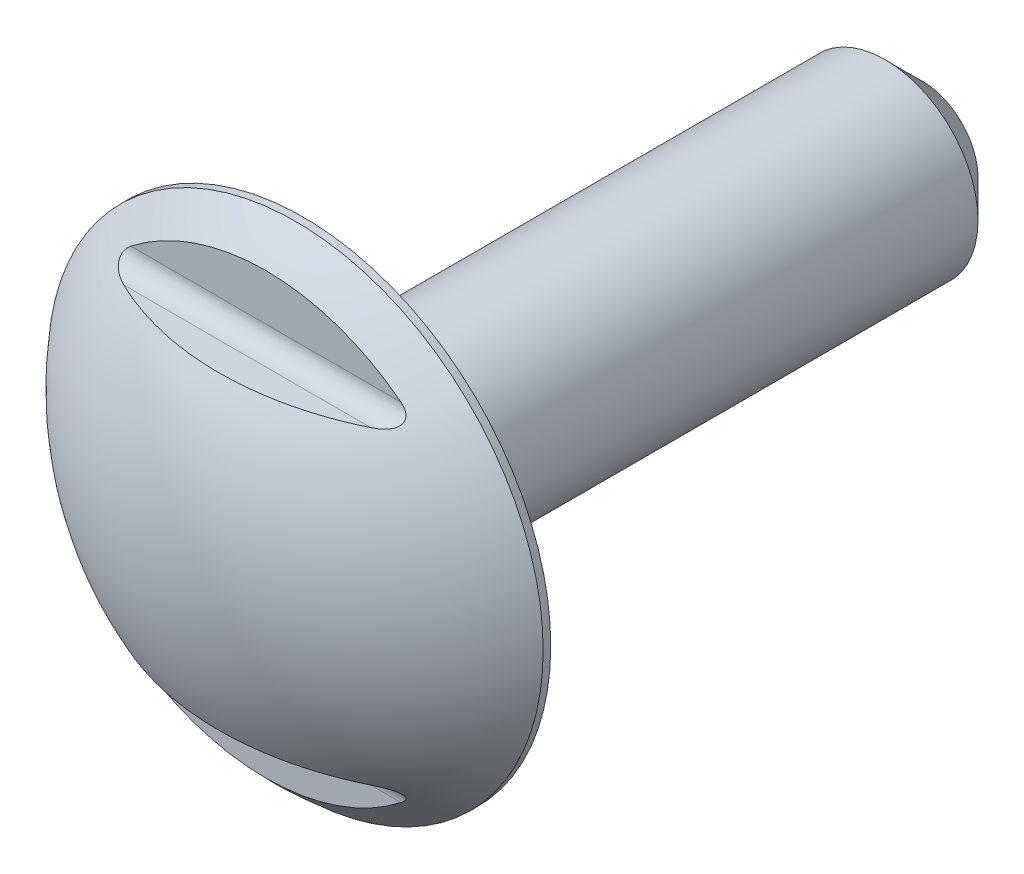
ISO-10303-21;
HEADER;
FILE_DESCRIPTION(('STEP AP214'),'2;1');
FILE_NAME('part.step','',(''),(''),'','','');
FILE_SCHEMA(('AUTOMOTIVE_DESIGN { 1 0 10303 214 1 1 1 1 }'));
ENDSEC;
DATA;
#1=APPLICATION_CONTEXT('core data for automotive mechanical design processes');
#2=APPLICATION_PROTOCOL_DEFINITION('international standard','automotive_design',2000,#1);
#3=PRODUCT_CONTEXT('',#1,'mechanical');
#4=PRODUCT('Part','Part','',(#3));
#5=PRODUCT_RELATED_PRODUCT_CATEGORY('part','',(#4));
#6=PRODUCT_DEFINITION_FORMATION('','',#4);
#7=PRODUCT_DEFINITION_CONTEXT('part definition',#1,'design');
#8=PRODUCT_DEFINITION('design','',#6,#7);
#9=PRODUCT_DEFINITION_SHAPE('','',#8);
#10=(LENGTH_UNIT() NAMED_UNIT(*) SI_UNIT(.MILLI.,.METRE.));
#11=(NAMED_UNIT(*) PLANE_ANGLE_UNIT() SI_UNIT($,.RADIAN.));
#12=(NAMED_UNIT(*) SI_UNIT($,.STERADIAN.) SOLID_ANGLE_UNIT());
#13=UNCERTAINTY_MEASURE_WITH_UNIT(LENGTH_MEASURE(1.E-05),#10,'distance_accuracy_value','');
#14=(GEOMETRIC_REPRESENTATION_CONTEXT(3) GLOBAL_UNCERTAINTY_ASSIGNED_CONTEXT((#13)) GLOBAL_UNIT_ASSIGNED_CONTEXT((#10,
#11,#12)) REPRESENTATION_CONTEXT('',''));
#15=CARTESIAN_POINT('',(0.,0.,0.));
#16=DIRECTION('',(0.,0.,1.));
#17=DIRECTION('',(1.,0.,0.));
#18=AXIS2_PLACEMENT_3D('',#15,#16,#17);
#19=CARTESIAN_POINT('',(0.,0.,-8.));
#20=DIRECTION('',(0.,0.,-1.));
#21=DIRECTION('',(1.,0.,0.));
#22=AXIS2_PLACEMENT_3D('',#19,#20,#21);
#23=CYLINDRICAL_SURFACE('',#22,4.);
#24=CARTESIAN_POINT('',(0.,0.,0.));
#25=DIRECTION('',(0.,0.,-1.));
#26=DIRECTION('',(1.,0.,0.));
#27=AXIS2_PLACEMENT_3D('',#24,#25,#26);
#28=CIRCLE('',#27,4.);
#29=CARTESIAN_POINT('',(4.,0.,0.));
#30=VERTEX_POINT('',#29);
#31=EDGE_CURVE('E59',#30,#30,#28,.T.);
#32=ORIENTED_EDGE('',*,*,#31,.F.);
#33=EDGE_LOOP('',(#32));
#34=FACE_BOUND('',#33,.T.);
#35=CARTESIAN_POINT('',(0.,0.,0.12264954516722));
#36=DIRECTION('',(0.,0.,1.));
#37=DIRECTION('',(-1.,0.,0.));
#38=AXIS2_PLACEMENT_3D('',#35,#36,#37);
#39=CIRCLE('',#38,4.);
#40=CARTESIAN_POINT('',(-4.,0.,0.12264954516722));
#41=VERTEX_POINT('',#40);
#42=EDGE_CURVE('E174',#41,#41,#39,.T.);
#43=ORIENTED_EDGE('',*,*,#42,.F.);
#44=EDGE_LOOP('',(#43));
#45=FACE_BOUND('',#44,.T.);
#46=ADVANCED_FACE('F14',(#34,#45),#23,.T.);
#47=CARTESIAN_POINT('',(0.,-4.,0.));
#48=DIRECTION('',(0.,0.,1.));
#49=DIRECTION('',(-1.,0.,0.));
#50=AXIS2_PLACEMENT_3D('',#47,#48,#49);
#51=PLANE('',#50);
#52=CARTESIAN_POINT('',(0.,0.,0.));
#53=DIRECTION('',(0.,0.,-1.));
#54=DIRECTION('',(1.,0.,0.));
#55=AXIS2_PLACEMENT_3D('',#52,#53,#54);
#56=CIRCLE('',#55,1.3);
#57=CARTESIAN_POINT('',(1.3,0.,0.));
#58=VERTEX_POINT('',#57);
#59=EDGE_CURVE('E188',#58,#58,#56,.T.);
#60=ORIENTED_EDGE('',*,*,#59,.F.);
#61=EDGE_LOOP('',(#60));
#62=FACE_BOUND('',#61,.T.);
#63=ORIENTED_EDGE('',*,*,#31,.T.);
#64=EDGE_LOOP('',(#63));
#65=FACE_BOUND('',#64,.T.);
#66=ADVANCED_FACE('F137',(#62,#65),#51,.F.);
#67=CARTESIAN_POINT('',(0.,0.,-0.2));
#68=DIRECTION('',(0.,0.,-1.));
#69=DIRECTION('',(1.,0.,0.));
#70=AXIS2_PLACEMENT_3D('',#67,#68,#69);
#71=TOROIDAL_SURFACE('',#70,1.3,0.2);
#72=CARTESIAN_POINT('',(0.,0.,-0.2));
#73=DIRECTION('',(0.,0.,-1.));
#74=DIRECTION('',(1.,0.,0.));
#75=AXIS2_PLACEMENT_3D('',#72,#73,#74);
#76=CIRCLE('',#75,1.1);
#77=CARTESIAN_POINT('',(1.1,0.,-0.2));
#78=VERTEX_POINT('',#77);
#79=EDGE_CURVE('E185',#78,#78,#76,.T.);
#80=ORIENTED_EDGE('',*,*,#79,.F.);
#81=EDGE_LOOP('',(#80));
#82=FACE_BOUND('',#81,.T.);
#83=ORIENTED_EDGE('',*,*,#59,.T.);
#84=EDGE_LOOP('',(#83));
#85=FACE_BOUND('',#84,.T.);
#86=ADVANCED_FACE('F142',(#82,#85),#71,.F.);
#87=CARTESIAN_POINT('',(0.,0.,-8.));
#88=DIRECTION('',(0.,0.,-1.));
#89=DIRECTION('',(1.,0.,0.));
#90=AXIS2_PLACEMENT_3D('',#87,#88,#89);
#91=CYLINDRICAL_SURFACE('',#90,1.1);
#92=CARTESIAN_POINT('',(0.,0.,-0.353589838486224));
#93=DIRECTION('',(0.,0.,-1.));
#94=DIRECTION('',(1.,0.,0.));
#95=AXIS2_PLACEMENT_3D('',#92,#93,#94);
#96=CIRCLE('',#95,1.1);
#97=CARTESIAN_POINT('',(1.1,0.,-0.353589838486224));
#98=VERTEX_POINT('',#97);
#99=EDGE_CURVE('E177',#98,#98,#96,.T.);
#100=ORIENTED_EDGE('',*,*,#99,.F.);
#101=EDGE_LOOP('',(#100));
#102=FACE_BOUND('',#101,.T.);
#103=ORIENTED_EDGE('',*,*,#79,.T.);
#104=EDGE_LOOP('',(#103));
#105=FACE_BOUND('',#104,.T.);
#106=ADVANCED_FACE('F150',(#102,#105),#91,.T.);
#107=CARTESIAN_POINT('',(0.,0.,-0.353589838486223));
#108=DIRECTION('',(0.,0.,-1.));
#109=DIRECTION('',(1.,0.,0.));
#110=AXIS2_PLACEMENT_3D('',#107,#108,#109);
#111=TOROIDAL_SURFACE('',#110,1.3,0.200000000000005);
#112=CARTESIAN_POINT('',(0.,0.,-0.453589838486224));
#113=DIRECTION('',(0.,0.,-1.));
#114=DIRECTION('',(1.,0.,0.));
#115=AXIS2_PLACEMENT_3D('',#112,#113,#114);
#116=CIRCLE('',#115,1.12679491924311);
#117=CARTESIAN_POINT('',(1.12679491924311,0.,-0.453589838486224));
#118=VERTEX_POINT('',#117);
#119=EDGE_CURVE('E173',#118,#118,#116,.T.);
#120=ORIENTED_EDGE('',*,*,#119,.F.);
#121=EDGE_LOOP('',(#120));
#122=FACE_BOUND('',#121,.T.);
#123=ORIENTED_EDGE('',*,*,#99,.T.);
#124=EDGE_LOOP('',(#123));
#125=FACE_BOUND('',#124,.T.);
#126=ADVANCED_FACE('F154',(#122,#125),#111,.F.);
#127=CARTESIAN_POINT('',(0.,0.,-0.453589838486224));
#128=DIRECTION('',(0.,0.,-1.));
#129=DIRECTION('',(1.,0.,0.));
#130=AXIS2_PLACEMENT_3D('',#127,#128,#129);
#131=CONICAL_SURFACE('',#130,1.12679491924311,0.523598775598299);
#132=CARTESIAN_POINT('',(0.,0.,-1.1));
#133=DIRECTION('',(0.,0.,-1.));
#134=DIRECTION('',(1.,0.,0.));
#135=AXIS2_PLACEMENT_3D('',#132,#133,#134);
#136=CIRCLE('',#135,1.5);
#137=CARTESIAN_POINT('',(1.5,0.,-1.1));
#138=VERTEX_POINT('',#137);
#139=EDGE_CURVE('E172',#138,#138,#136,.T.);
#140=ORIENTED_EDGE('',*,*,#139,.F.);
#141=EDGE_LOOP('',(#140));
#142=FACE_BOUND('',#141,.T.);
#143=ORIENTED_EDGE('',*,*,#119,.T.);
#144=EDGE_LOOP('',(#143));
#145=FACE_BOUND('',#144,.T.);
#146=ADVANCED_FACE('F158',(#142,#145),#131,.T.);
#147=CARTESIAN_POINT('',(0.,0.,-8.));
#148=DIRECTION('',(0.,0.,-1.));
#149=DIRECTION('',(1.,0.,0.));
#150=AXIS2_PLACEMENT_3D('',#147,#148,#149);
#151=CYLINDRICAL_SURFACE('',#150,1.5);
#152=CARTESIAN_POINT('',(0.,0.,-9.4));
#153=DIRECTION('',(0.,0.,-1.));
#154=DIRECTION('',(-1.,0.,0.));
#155=AXIS2_PLACEMENT_3D('',#152,#153,#154);
#156=CIRCLE('',#155,1.5);
#157=CARTESIAN_POINT('',(-1.5,0.,-9.4));
#158=VERTEX_POINT('',#157);
#159=EDGE_CURVE('E9',#158,#158,#156,.F.);
#160=ORIENTED_EDGE('',*,*,#159,.T.);
#161=EDGE_LOOP('',(#160));
#162=FACE_BOUND('',#161,.T.);
#163=ORIENTED_EDGE('',*,*,#139,.T.);
#164=EDGE_LOOP('',(#163));
#165=FACE_BOUND('',#164,.T.);
#166=ADVANCED_FACE('F161',(#162,#165),#151,.T.);
#167=CARTESIAN_POINT('',(0.,0.,-3.2));
#168=DIRECTION('',(0.,0.,1.));
#169=DIRECTION('',(0.,-1.,0.));
#170=AXIS2_PLACEMENT_3D('',#167,#168,#169);
#171=SPHERICAL_SURFACE('',#170,5.2);
#172=CARTESIAN_POINT('',(0.,2.5,-3.2));
#173=DIRECTION('',(0.,-1.,0.));
#174=DIRECTION('',(1.,0.,0.));
#175=AXIS2_PLACEMENT_3D('',#172,#173,#174);
#176=CIRCLE('',#175,4.5596052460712);
#177=CARTESIAN_POINT('',(-1.99499373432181,2.5,0.9));
#178=VERTEX_POINT('',#177);
#179=CARTESIAN_POINT('',(1.994993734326,2.5,0.9));
#180=VERTEX_POINT('',#179);
#181=EDGE_CURVE('E124',#178,#180,#176,.F.);
#182=ORIENTED_EDGE('',*,*,#181,.F.);
#183=CARTESIAN_POINT('',(-2.18148560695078,2.8002,0.600000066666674));
#184=CARTESIAN_POINT('',(-2.19362930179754,2.7907147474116,0.600019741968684));
#185=CARTESIAN_POINT('',(-2.20552699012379,2.78074549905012,0.600440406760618));
#186=CARTESIAN_POINT('',(-2.22841120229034,2.75955495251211,0.602536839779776));
#187=CARTESIAN_POINT('',(-2.23937741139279,2.7483143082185,0.604235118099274));
#188=CARTESIAN_POINT('',(-2.25595559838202,2.72879878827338,0.608467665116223));
#189=CARTESIAN_POINT('',(-2.26209375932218,2.72087219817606,0.610497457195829));
#190=CARTESIAN_POINT('',(-2.27325803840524,2.70456948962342,0.61545602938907));
#191=CARTESIAN_POINT('',(-2.27828965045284,2.69619586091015,0.618380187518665));
#192=CARTESIAN_POINT('',(-2.28588020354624,2.68105068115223,0.624497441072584));
#193=CARTESIAN_POINT('',(-2.28874117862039,2.67434707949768,0.627478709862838));
#194=CARTESIAN_POINT('',(-2.29334802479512,2.66087716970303,0.634103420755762));
#195=CARTESIAN_POINT('',(-2.29509452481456,2.6541108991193,0.637746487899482));
#196=CARTESIAN_POINT('',(-2.29730461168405,2.64068344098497,0.645678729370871));
#197=CARTESIAN_POINT('',(-2.29775998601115,2.63402319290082,0.649971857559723));
#198=CARTESIAN_POINT('',(-2.29731000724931,2.6210966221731,0.659051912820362));
#199=CARTESIAN_POINT('',(-2.29640447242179,2.61483035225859,0.663838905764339));
#200=CARTESIAN_POINT('',(-2.29348190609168,2.60344375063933,0.673250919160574));
#201=CARTESIAN_POINT('',(-2.29157722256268,2.59827106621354,0.677848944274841));
#202=CARTESIAN_POINT('',(-2.28688710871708,2.58846666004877,0.68716336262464));
#203=CARTESIAN_POINT('',(-2.28410141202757,2.58383510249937,0.691879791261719));
#204=CARTESIAN_POINT('',(-2.2759175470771,2.57248877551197,0.704181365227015));
#205=CARTESIAN_POINT('',(-2.26995648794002,2.56619967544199,0.71178320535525));
#206=CARTESIAN_POINT('',(-2.25676803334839,2.55486022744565,0.726807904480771));
#207=CARTESIAN_POINT('',(-2.24953697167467,2.54981357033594,0.734230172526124));
#208=CARTESIAN_POINT('',(-2.228331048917,2.53726193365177,0.754396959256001));
#209=CARTESIAN_POINT('',(-2.21344357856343,2.53084751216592,0.766848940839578));
#210=CARTESIAN_POINT('',(-2.18216661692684,2.52025272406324,0.790851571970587));
#211=CARTESIAN_POINT('',(-2.16576887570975,2.51608559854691,0.802396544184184));
#212=CARTESIAN_POINT('',(-2.12425701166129,2.50783454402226,0.829788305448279));
#213=CARTESIAN_POINT('',(-2.09863400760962,2.50468951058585,0.845140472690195));
#214=CARTESIAN_POINT('',(-2.05972898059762,2.50175690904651,0.866810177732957));
#215=CARTESIAN_POINT('',(-2.0468228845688,2.50107500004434,0.873739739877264));
#216=CARTESIAN_POINT('',(-2.02083255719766,2.50019563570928,0.88723270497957));
#217=CARTESIAN_POINT('',(-2.00774867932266,2.49999732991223,0.893796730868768));
#218=CARTESIAN_POINT('',(-1.99458256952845,2.50000006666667,0.900199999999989));
#219=B_SPLINE_CURVE_WITH_KNOTS('',3,(#183,#184,#185,#186,#187,#188,#189,#190,#191,#192,#193,
#194,#195,#196,#197,#198,#199,#200,#201,#202,#203,#204,#205,#206,#207,#208,#209,#210,#211,#212,
#213,#214,#215,#216,#217,#218),.UNSPECIFIED.,.F.,.F.,(4,2,2,2,2,2,2,2,2,2,2,2,2,2,2,2,2,4),(0.,
0.0463823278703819,0.0936015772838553,0.124204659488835,0.154652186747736,0.17818623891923,
0.201706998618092,0.225377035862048,0.249050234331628,0.270500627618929,0.291957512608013,
0.326339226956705,0.360821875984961,0.421799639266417,0.483132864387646,0.572973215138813,
0.61696059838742,0.660870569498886),.UNSPECIFIED.);
#220=CARTESIAN_POINT('',(-2.18174242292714,2.8,0.6));
#221=VERTEX_POINT('',#220);
#222=EDGE_CURVE('E111',#221,#178,#219,.T.);
#223=ORIENTED_EDGE('',*,*,#222,.F.);
#224=CARTESIAN_POINT('',(0.,0.,0.6));
#225=DIRECTION('',(0.,0.,-1.));
#226=DIRECTION('',(0.,-1.,0.));
#227=AXIS2_PLACEMENT_3D('',#224,#225,#226);
#228=CIRCLE('',#227,3.54964786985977);
#229=CARTESIAN_POINT('',(2.18174242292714,2.8,0.6));
#230=VERTEX_POINT('',#229);
#231=EDGE_CURVE('E208',#230,#221,#228,.F.);
#232=ORIENTED_EDGE('',*,*,#231,.F.);
#233=CARTESIAN_POINT('',(1.99458256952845,2.50000006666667,0.900199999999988));
#234=CARTESIAN_POINT('',(2.00924618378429,2.5000008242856,0.89306640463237));
#235=CARTESIAN_POINT('',(2.02381938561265,2.50024530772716,0.88573062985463));
#236=CARTESIAN_POINT('',(2.05275138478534,2.50134632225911,0.870595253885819));
#237=CARTESIAN_POINT('',(2.06710944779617,2.50220460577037,0.862794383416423));
#238=CARTESIAN_POINT('',(2.09559928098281,2.50466845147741,0.846649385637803));
#239=CARTESIAN_POINT('',(2.10972854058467,2.50627957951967,0.838301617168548));
#240=CARTESIAN_POINT('',(2.13750512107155,2.51043126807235,0.821079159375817));
#241=CARTESIAN_POINT('',(2.15115302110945,2.51297066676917,0.812205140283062));
#242=CARTESIAN_POINT('',(2.17627000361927,2.51887670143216,0.794912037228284));
#243=CARTESIAN_POINT('',(2.18781075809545,2.52211702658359,0.786555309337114));
#244=CARTESIAN_POINT('',(2.21014903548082,2.52978442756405,0.769338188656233));
#245=CARTESIAN_POINT('',(2.22094523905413,2.53421354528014,0.760476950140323));
#246=CARTESIAN_POINT('',(2.24153862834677,2.54467843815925,0.742123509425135));
#247=CARTESIAN_POINT('',(2.2513161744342,2.55073975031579,0.73262325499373));
#248=CARTESIAN_POINT('',(2.26886803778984,2.56488191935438,0.713289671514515));
#249=CARTESIAN_POINT('',(2.27665487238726,2.5729494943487,0.70345888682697));
#250=CARTESIAN_POINT('',(2.28604704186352,2.58697138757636,0.688653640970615));
#251=CARTESIAN_POINT('',(2.2888237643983,2.59207417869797,0.68361895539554));
#252=CARTESIAN_POINT('',(2.29331344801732,2.60288770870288,0.673725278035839));
#253=CARTESIAN_POINT('',(2.29502729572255,2.60859793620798,0.668866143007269));
#254=CARTESIAN_POINT('',(2.29723548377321,2.62055773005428,0.6594618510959));
#255=CARTESIAN_POINT('',(2.29772227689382,2.62681039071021,0.654918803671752));
#256=CARTESIAN_POINT('',(2.29739959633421,2.6396274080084,0.64634653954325));
#257=CARTESIAN_POINT('',(2.29658995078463,2.64619180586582,0.642317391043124));
#258=CARTESIAN_POINT('',(2.29386629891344,2.65892418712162,0.635146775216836));
#259=CARTESIAN_POINT('',(2.29203628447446,2.66508655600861,0.631962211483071));
#260=CARTESIAN_POINT('',(2.28748498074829,2.67733185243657,0.626141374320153));
#261=CARTESIAN_POINT('',(2.28476373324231,2.6834147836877,0.623505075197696));
#262=CARTESIAN_POINT('',(2.27680636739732,2.69887909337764,0.617372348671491));
#263=CARTESIAN_POINT('',(2.27102624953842,2.70813198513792,0.614261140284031));
#264=CARTESIAN_POINT('',(2.25818412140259,2.72607760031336,0.609098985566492));
#265=CARTESIAN_POINT('',(2.25111402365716,2.73476629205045,0.607055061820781));
#266=CARTESIAN_POINT('',(2.23421100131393,2.75365124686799,0.603407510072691));
#267=CARTESIAN_POINT('',(2.2241325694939,2.76366946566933,0.602047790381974));
#268=CARTESIAN_POINT('',(2.20326210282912,2.78264375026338,0.600358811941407));
#269=CARTESIAN_POINT('',(2.19248616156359,2.79161567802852,0.600011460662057));
#270=CARTESIAN_POINT('',(2.18148560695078,2.8002,0.600000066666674));
#271=B_SPLINE_CURVE_WITH_KNOTS('',3,(#233,#234,#235,#236,#237,#238,#239,#240,#241,#242,#243,
#244,#245,#246,#247,#248,#249,#250,#251,#252,#253,#254,#255,#256,#257,#258,#259,#260,#261,#262,
#263,#264,#265,#266,#267,#268,#269,#270),.UNSPECIFIED.,.F.,.F.,(4,2,2,2,2,2,2,2,2,2,2,2,2,2,2,2,
2,2,4),(0.,0.0489276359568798,0.0979955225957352,0.147432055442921,0.196806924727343,
0.240588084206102,0.284444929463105,0.329032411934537,0.373332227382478,0.396312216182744,
0.419273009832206,0.442374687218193,0.465479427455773,0.486915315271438,0.508350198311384,
0.542190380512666,0.576250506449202,0.618966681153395,0.660914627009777),.UNSPECIFIED.);
#272=EDGE_CURVE('E118',#180,#230,#271,.T.);
#273=ORIENTED_EDGE('',*,*,#272,.F.);
#274=EDGE_LOOP('',(#182,#223,#232,#273));
#275=FACE_BOUND('',#274,.T.);
#276=CARTESIAN_POINT('',(0.,-2.5,-3.2));
#277=DIRECTION('',(0.,1.,0.));
#278=DIRECTION('',(-1.,0.,0.));
#279=AXIS2_PLACEMENT_3D('',#276,#277,#278);
#280=CIRCLE('',#279,4.55960524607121);
#281=CARTESIAN_POINT('',(1.99499373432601,-2.5,0.9));
#282=VERTEX_POINT('',#281);
#283=CARTESIAN_POINT('',(-1.99499373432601,-2.5,0.9));
#284=VERTEX_POINT('',#283);
#285=EDGE_CURVE('E71',#282,#284,#280,.F.);
#286=ORIENTED_EDGE('',*,*,#285,.F.);
#287=CARTESIAN_POINT('',(2.1814856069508,-2.8002,0.600000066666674));
#288=CARTESIAN_POINT('',(2.19362930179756,-2.7907147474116,0.600019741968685));
#289=CARTESIAN_POINT('',(2.20552699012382,-2.78074549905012,0.600440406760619));
#290=CARTESIAN_POINT('',(2.22841120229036,-2.75955495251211,0.602536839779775));
#291=CARTESIAN_POINT('',(2.23937741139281,-2.74831430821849,0.604235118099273));
#292=CARTESIAN_POINT('',(2.25595559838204,-2.72879878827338,0.608467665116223));
#293=CARTESIAN_POINT('',(2.2620937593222,-2.72087219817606,0.610497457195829));
#294=CARTESIAN_POINT('',(2.27325803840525,-2.70456948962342,0.61545602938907));
#295=CARTESIAN_POINT('',(2.27828965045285,-2.69619586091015,0.618380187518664));
#296=CARTESIAN_POINT('',(2.28588020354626,-2.68105068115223,0.624497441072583));
#297=CARTESIAN_POINT('',(2.28874117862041,-2.67434707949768,0.627478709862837));
#298=CARTESIAN_POINT('',(2.29334802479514,-2.66087716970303,0.634103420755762));
#299=CARTESIAN_POINT('',(2.29509452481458,-2.6541108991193,0.637746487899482));
#300=CARTESIAN_POINT('',(2.29730461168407,-2.64068344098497,0.645678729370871));
#301=CARTESIAN_POINT('',(2.29775998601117,-2.63402319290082,0.649971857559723));
#302=CARTESIAN_POINT('',(2.29731000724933,-2.62109662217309,0.659051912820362));
#303=CARTESIAN_POINT('',(2.29640447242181,-2.61483035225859,0.663838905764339));
#304=CARTESIAN_POINT('',(2.2934819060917,-2.60344375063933,0.673250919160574));
#305=CARTESIAN_POINT('',(2.2915772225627,-2.59827106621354,0.677848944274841));
#306=CARTESIAN_POINT('',(2.28688710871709,-2.58846666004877,0.68716336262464));
#307=CARTESIAN_POINT('',(2.28410141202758,-2.58383510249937,0.691879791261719));
#308=CARTESIAN_POINT('',(2.27591754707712,-2.57248877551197,0.704181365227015));
#309=CARTESIAN_POINT('',(2.26995648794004,-2.56619967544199,0.711783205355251));
#310=CARTESIAN_POINT('',(2.25676803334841,-2.55486022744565,0.726807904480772));
#311=CARTESIAN_POINT('',(2.24953697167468,-2.54981357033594,0.734230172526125));
#312=CARTESIAN_POINT('',(2.22833104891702,-2.53726193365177,0.754396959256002));
#313=CARTESIAN_POINT('',(2.21344357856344,-2.53084751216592,0.76684894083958));
#314=CARTESIAN_POINT('',(2.18216661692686,-2.52025272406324,0.79085157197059));
#315=CARTESIAN_POINT('',(2.16576887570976,-2.5160855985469,0.802396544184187));
#316=CARTESIAN_POINT('',(2.12425701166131,-2.50783454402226,0.829788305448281));
#317=CARTESIAN_POINT('',(2.09863400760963,-2.50468951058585,0.845140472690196));
#318=CARTESIAN_POINT('',(2.05972898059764,-2.50175690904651,0.866810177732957));
#319=CARTESIAN_POINT('',(2.04682288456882,-2.50107500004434,0.873739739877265));
#320=CARTESIAN_POINT('',(2.02083255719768,-2.50019563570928,0.88723270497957));
#321=CARTESIAN_POINT('',(2.00774867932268,-2.49999732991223,0.893796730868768));
#322=CARTESIAN_POINT('',(1.99458256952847,-2.50000006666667,0.900199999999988));
#323=B_SPLINE_CURVE_WITH_KNOTS('',3,(#287,#288,#289,#290,#291,#292,#293,#294,#295,#296,#297,
#298,#299,#300,#301,#302,#303,#304,#305,#306,#307,#308,#309,#310,#311,#312,#313,#314,#315,#316,
#317,#318,#319,#320,#321,#322),.UNSPECIFIED.,.F.,.F.,(4,2,2,2,2,2,2,2,2,2,2,2,2,2,2,2,2,4),(0.,
0.0463823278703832,0.0936015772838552,0.124204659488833,0.154652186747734,0.178186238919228,
0.201706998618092,0.225377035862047,0.249050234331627,0.270500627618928,0.291957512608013,
0.326339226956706,0.360821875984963,0.421799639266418,0.483132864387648,0.572973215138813,
0.616960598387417,0.660870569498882),.UNSPECIFIED.);
#324=CARTESIAN_POINT('',(2.18174242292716,-2.8,0.6));
#325=VERTEX_POINT('',#324);
#326=EDGE_CURVE('E58',#325,#282,#323,.T.);
#327=ORIENTED_EDGE('',*,*,#326,.F.);
#328=CARTESIAN_POINT('',(0.,0.,0.6));
#329=DIRECTION('',(0.,0.,-1.));
#330=DIRECTION('',(0.,-1.,0.));
#331=AXIS2_PLACEMENT_3D('',#328,#329,#330);
#332=CIRCLE('',#331,3.54964786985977);
#333=CARTESIAN_POINT('',(-2.18174242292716,-2.8,0.6));
#334=VERTEX_POINT('',#333);
#335=EDGE_CURVE('E53',#334,#325,#332,.F.);
#336=ORIENTED_EDGE('',*,*,#335,.F.);
#337=CARTESIAN_POINT('',(-1.99458256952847,-2.50000006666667,0.900199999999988));
#338=CARTESIAN_POINT('',(-2.00924618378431,-2.5000008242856,0.89306640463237));
#339=CARTESIAN_POINT('',(-2.02381938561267,-2.50024530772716,0.88573062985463));
#340=CARTESIAN_POINT('',(-2.05275138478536,-2.50134632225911,0.870595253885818));
#341=CARTESIAN_POINT('',(-2.06710944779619,-2.50220460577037,0.862794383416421));
#342=CARTESIAN_POINT('',(-2.09559928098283,-2.50466845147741,0.846649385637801));
#343=CARTESIAN_POINT('',(-2.10972854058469,-2.50627957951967,0.838301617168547));
#344=CARTESIAN_POINT('',(-2.13750512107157,-2.51043126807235,0.821079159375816));
#345=CARTESIAN_POINT('',(-2.15115302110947,-2.51297066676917,0.812205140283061));
#346=CARTESIAN_POINT('',(-2.17627000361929,-2.51887670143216,0.794912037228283));
#347=CARTESIAN_POINT('',(-2.18781075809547,-2.52211702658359,0.786555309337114));
#348=CARTESIAN_POINT('',(-2.21014903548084,-2.52978442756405,0.769338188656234));
#349=CARTESIAN_POINT('',(-2.22094523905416,-2.53421354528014,0.760476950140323));
#350=CARTESIAN_POINT('',(-2.24153862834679,-2.54467843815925,0.742123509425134));
#351=CARTESIAN_POINT('',(-2.25131617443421,-2.55073975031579,0.732623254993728));
#352=CARTESIAN_POINT('',(-2.26886803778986,-2.56488191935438,0.713289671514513));
#353=CARTESIAN_POINT('',(-2.27665487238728,-2.5729494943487,0.703458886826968));
#354=CARTESIAN_POINT('',(-2.28604704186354,-2.58697138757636,0.688653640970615));
#355=CARTESIAN_POINT('',(-2.28882376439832,-2.59207417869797,0.683618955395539));
#356=CARTESIAN_POINT('',(-2.29331344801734,-2.60288770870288,0.673725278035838));
#357=CARTESIAN_POINT('',(-2.29502729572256,-2.60859793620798,0.668866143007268));
#358=CARTESIAN_POINT('',(-2.29723548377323,-2.62055773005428,0.659461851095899));
#359=CARTESIAN_POINT('',(-2.29772227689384,-2.62681039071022,0.654918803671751));
#360=CARTESIAN_POINT('',(-2.29739959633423,-2.6396274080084,0.646346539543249));
#361=CARTESIAN_POINT('',(-2.29658995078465,-2.64619180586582,0.642317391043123));
#362=CARTESIAN_POINT('',(-2.29386629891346,-2.65892418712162,0.635146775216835));
#363=CARTESIAN_POINT('',(-2.29203628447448,-2.66508655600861,0.631962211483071));
#364=CARTESIAN_POINT('',(-2.2874849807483,-2.67733185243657,0.626141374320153));
#365=CARTESIAN_POINT('',(-2.28476373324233,-2.6834147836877,0.623505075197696));
#366=CARTESIAN_POINT('',(-2.27680636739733,-2.69887909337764,0.61737234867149));
#367=CARTESIAN_POINT('',(-2.27102624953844,-2.70813198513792,0.61426114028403));
#368=CARTESIAN_POINT('',(-2.25818412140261,-2.72607760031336,0.609098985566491));
#369=CARTESIAN_POINT('',(-2.25111402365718,-2.73476629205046,0.60705506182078));
#370=CARTESIAN_POINT('',(-2.23421100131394,-2.75365124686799,0.60340751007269));
#371=CARTESIAN_POINT('',(-2.22413256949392,-2.76366946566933,0.602047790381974));
#372=CARTESIAN_POINT('',(-2.20326210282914,-2.78264375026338,0.600358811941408));
#373=CARTESIAN_POINT('',(-2.19248616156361,-2.79161567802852,0.600011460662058));
#374=CARTESIAN_POINT('',(-2.1814856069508,-2.8002,0.600000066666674));
#375=B_SPLINE_CURVE_WITH_KNOTS('',3,(#337,#338,#339,#340,#341,#342,#343,#344,#345,#346,#347,
#348,#349,#350,#351,#352,#353,#354,#355,#356,#357,#358,#359,#360,#361,#362,#363,#364,#365,#366,
#367,#368,#369,#370,#371,#372,#373,#374),.UNSPECIFIED.,.F.,.F.,(4,2,2,2,2,2,2,2,2,2,2,2,2,2,2,2,
2,2,4),(0.,0.0489276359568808,0.0979955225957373,0.147432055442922,0.196806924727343,
0.240588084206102,0.284444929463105,0.329032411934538,0.373332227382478,0.396312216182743,
0.419273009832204,0.442374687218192,0.465479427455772,0.486915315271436,0.508350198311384,
0.542190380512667,0.576250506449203,0.618966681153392,0.660914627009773),.UNSPECIFIED.);
#376=EDGE_CURVE('E65',#284,#334,#375,.T.);
#377=ORIENTED_EDGE('',*,*,#376,.F.);
#378=EDGE_LOOP('',(#286,#327,#336,#377));
#379=FACE_BOUND('',#378,.T.);
#380=ORIENTED_EDGE('',*,*,#42,.T.);
#381=EDGE_LOOP('',(#380));
#382=FACE_BOUND('',#381,.T.);
#383=ADVANCED_FACE('F69',(#275,#379,#382),#171,.T.);
#384=CARTESIAN_POINT('',(5.,-2.8,0.9));
#385=DIRECTION('',(-1.,0.,0.));
#386=DIRECTION('',(0.,-1.,0.));
#387=AXIS2_PLACEMENT_3D('',#384,#385,#386);
#388=CYLINDRICAL_SURFACE('',#387,0.3);
#389=ORIENTED_EDGE('',*,*,#376,.T.);
#390=DIRECTION('',(-1.,0.,0.));
#391=VECTOR('',#390,1.);
#392=CARTESIAN_POINT('',(5.,-2.8,0.6));
#393=LINE('',#392,#391);
#394=EDGE_CURVE('E35',#325,#334,#393,.T.);
#395=ORIENTED_EDGE('',*,*,#394,.F.);
#396=ORIENTED_EDGE('',*,*,#326,.T.);
#397=DIRECTION('',(-1.,0.,0.));
#398=VECTOR('',#397,1.);
#399=CARTESIAN_POINT('',(5.,-2.5,0.9));
#400=LINE('',#399,#398);
#401=EDGE_CURVE('E66',#282,#284,#400,.T.);
#402=ORIENTED_EDGE('',*,*,#401,.T.);
#403=EDGE_LOOP('',(#389,#395,#396,#402));
#404=FACE_BOUND('',#403,.T.);
#405=ADVANCED_FACE('F62',(#404),#388,.F.);
#406=CARTESIAN_POINT('',(5.,-2.5,1.91367347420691));
#407=DIRECTION('',(0.,1.,0.));
#408=DIRECTION('',(-1.,0.,0.));
#409=AXIS2_PLACEMENT_3D('',#406,#407,#408);
#410=PLANE('',#409);
#411=ORIENTED_EDGE('',*,*,#285,.T.);
#412=ORIENTED_EDGE('',*,*,#401,.F.);
#413=EDGE_LOOP('',(#411,#412));
#414=FACE_BOUND('',#413,.T.);
#415=ADVANCED_FACE('F91',(#414),#410,.F.);
#416=CARTESIAN_POINT('',(5.,-2.8,0.6));
#417=DIRECTION('',(0.,0.,-1.));
#418=DIRECTION('',(0.,-1.,0.));
#419=AXIS2_PLACEMENT_3D('',#416,#417,#418);
#420=PLANE('',#419);
#421=ORIENTED_EDGE('',*,*,#335,.T.);
#422=ORIENTED_EDGE('',*,*,#394,.T.);
#423=EDGE_LOOP('',(#421,#422));
#424=FACE_BOUND('',#423,.T.);
#425=ADVANCED_FACE('F54',(#424),#420,.F.);
#426=CARTESIAN_POINT('',(5.,2.5,1.91367347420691));
#427=DIRECTION('',(0.,-1.,0.));
#428=DIRECTION('',(1.,0.,0.));
#429=AXIS2_PLACEMENT_3D('',#426,#427,#428);
#430=PLANE('',#429);
#431=ORIENTED_EDGE('',*,*,#181,.T.);
#432=DIRECTION('',(-1.,0.,0.));
#433=VECTOR('',#432,1.);
#434=CARTESIAN_POINT('',(5.,2.5,0.9));
#435=LINE('',#434,#433);
#436=EDGE_CURVE('E180',#180,#178,#435,.T.);
#437=ORIENTED_EDGE('',*,*,#436,.T.);
#438=EDGE_LOOP('',(#431,#437));
#439=FACE_BOUND('',#438,.T.);
#440=ADVANCED_FACE('F95',(#439),#430,.F.);
#441=CARTESIAN_POINT('',(5.,2.8,0.9));
#442=DIRECTION('',(-1.,0.,0.));
#443=DIRECTION('',(0.,-1.,0.));
#444=AXIS2_PLACEMENT_3D('',#441,#442,#443);
#445=CYLINDRICAL_SURFACE('',#444,0.3);
#446=ORIENTED_EDGE('',*,*,#272,.T.);
#447=DIRECTION('',(-1.,0.,0.));
#448=VECTOR('',#447,1.);
#449=CARTESIAN_POINT('',(5.,2.8,0.6));
#450=LINE('',#449,#448);
#451=EDGE_CURVE('E28',#230,#221,#450,.T.);
#452=ORIENTED_EDGE('',*,*,#451,.T.);
#453=ORIENTED_EDGE('',*,*,#222,.T.);
#454=ORIENTED_EDGE('',*,*,#436,.F.);
#455=EDGE_LOOP('',(#446,#452,#453,#454));
#456=FACE_BOUND('',#455,.T.);
#457=ADVANCED_FACE('F103',(#456),#445,.F.);
#458=CARTESIAN_POINT('',(5.,2.8,0.6));
#459=DIRECTION('',(0.,0.,-1.));
#460=DIRECTION('',(0.,-1.,0.));
#461=AXIS2_PLACEMENT_3D('',#458,#459,#460);
#462=PLANE('',#461);
#463=ORIENTED_EDGE('',*,*,#231,.T.);
#464=ORIENTED_EDGE('',*,*,#451,.F.);
#465=EDGE_LOOP('',(#463,#464));
#466=FACE_BOUND('',#465,.T.);
#467=ADVANCED_FACE('F99',(#466),#462,.F.);
#468=CARTESIAN_POINT('',(0.,0.,-10.));
#469=DIRECTION('',(0.,0.,-1.));
#470=DIRECTION('',(-1.,0.,0.));
#471=AXIS2_PLACEMENT_3D('',#468,#469,#470);
#472=PLANE('',#471);
#473=CARTESIAN_POINT('',(0.,0.,-10.));
#474=DIRECTION('',(0.,0.,-1.));
#475=DIRECTION('',(-1.,0.,0.));
#476=AXIS2_PLACEMENT_3D('',#473,#474,#475);
#477=CIRCLE('',#476,0.9);
#478=CARTESIAN_POINT('',(-0.9,0.,-10.));
#479=VERTEX_POINT('',#478);
#480=EDGE_CURVE('E22',#479,#479,#477,.T.);
#481=ORIENTED_EDGE('',*,*,#480,.T.);
#482=EDGE_LOOP('',(#481));
#483=FACE_BOUND('',#482,.T.);
#484=ADVANCED_FACE('F102',(#483),#472,.T.);
#485=CARTESIAN_POINT('',(0.,0.,-10.));
#486=DIRECTION('',(0.,0.,1.));
#487=DIRECTION('',(1.,0.,0.));
#488=AXIS2_PLACEMENT_3D('',#485,#486,#487);
#489=CONICAL_SURFACE('',#488,0.9,0.785398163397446);
#490=ORIENTED_EDGE('',*,*,#159,.F.);
#491=EDGE_LOOP('',(#490));
#492=FACE_BOUND('',#491,.T.);
#493=ORIENTED_EDGE('',*,*,#480,.F.);
#494=EDGE_LOOP('',(#493));
#495=FACE_BOUND('',#494,.T.);
#496=ADVANCED_FACE('F16',(#492,#495),#489,.T.);
#497=CLOSED_SHELL('',(#46,#66,#86,#106,#126,#146,#166,#383,#405,#415,#425,#440,#457,#467,#484,#496));
#498=MANIFOLD_SOLID_BREP('B1',#497);
#499=ADVANCED_BREP_SHAPE_REPRESENTATION('',(#18,#498),#14);
#500=SHAPE_DEFINITION_REPRESENTATION(#9,#499);
ENDSEC;
END-ISO-10303-21;
